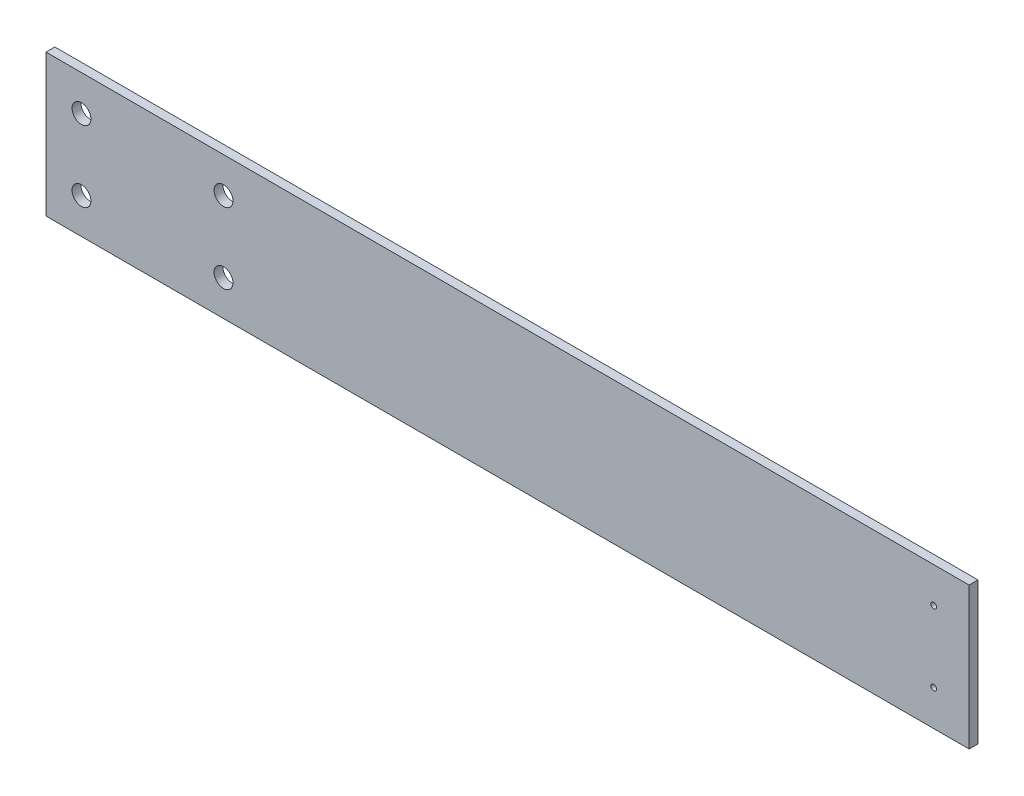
ISO-10303-21;
HEADER;
FILE_DESCRIPTION(('STEP AP214'),'2;1');
FILE_NAME('part.step','',(''),(''),'','','');
FILE_SCHEMA(('AUTOMOTIVE_DESIGN { 1 0 10303 214 1 1 1 1 }'));
ENDSEC;
DATA;
#1=APPLICATION_CONTEXT('core data for automotive mechanical design processes');
#2=APPLICATION_PROTOCOL_DEFINITION('international standard','automotive_design',2000,#1);
#3=PRODUCT_CONTEXT('',#1,'mechanical');
#4=PRODUCT('Part','Part','',(#3));
#5=PRODUCT_RELATED_PRODUCT_CATEGORY('part','',(#4));
#6=PRODUCT_DEFINITION_FORMATION('','',#4);
#7=PRODUCT_DEFINITION_CONTEXT('part definition',#1,'design');
#8=PRODUCT_DEFINITION('design','',#6,#7);
#9=PRODUCT_DEFINITION_SHAPE('','',#8);
#10=(LENGTH_UNIT() NAMED_UNIT(*) SI_UNIT(.MILLI.,.METRE.));
#11=(NAMED_UNIT(*) PLANE_ANGLE_UNIT() SI_UNIT($,.RADIAN.));
#12=(NAMED_UNIT(*) SI_UNIT($,.STERADIAN.) SOLID_ANGLE_UNIT());
#13=UNCERTAINTY_MEASURE_WITH_UNIT(LENGTH_MEASURE(1.E-05),#10,'distance_accuracy_value','');
#14=(GEOMETRIC_REPRESENTATION_CONTEXT(3) GLOBAL_UNCERTAINTY_ASSIGNED_CONTEXT((#13)) GLOBAL_UNIT_ASSIGNED_CONTEXT((#10,
#11,#12)) REPRESENTATION_CONTEXT('',''));
#15=CARTESIAN_POINT('',(0.,0.,0.));
#16=DIRECTION('',(0.,0.,1.));
#17=DIRECTION('',(1.,0.,0.));
#18=AXIS2_PLACEMENT_3D('',#15,#16,#17);
#19=CARTESIAN_POINT('',(0.,0.,3.175));
#20=DIRECTION('',(1.,0.,0.));
#21=DIRECTION('',(0.,0.,-1.));
#22=AXIS2_PLACEMENT_3D('',#19,#20,#21);
#23=PLANE('',#22);
#24=DIRECTION('',(0.,-1.,0.));
#25=VECTOR('',#24,1.);
#26=CARTESIAN_POINT('',(0.,0.,0.));
#27=LINE('',#26,#25);
#28=CARTESIAN_POINT('',(0.,50.8,0.));
#29=VERTEX_POINT('',#28);
#30=CARTESIAN_POINT('',(0.,0.,0.));
#31=VERTEX_POINT('',#30);
#32=EDGE_CURVE('E96',#29,#31,#27,.T.);
#33=ORIENTED_EDGE('',*,*,#32,.T.);
#34=DIRECTION('',(0.,0.,-1.));
#35=VECTOR('',#34,1.);
#36=CARTESIAN_POINT('',(0.,0.,3.175));
#37=LINE('',#36,#35);
#38=CARTESIAN_POINT('',(0.,0.,3.175));
#39=VERTEX_POINT('',#38);
#40=EDGE_CURVE('E11',#39,#31,#37,.T.);
#41=ORIENTED_EDGE('',*,*,#40,.F.);
#42=DIRECTION('',(0.,-1.,0.));
#43=VECTOR('',#42,1.);
#44=CARTESIAN_POINT('',(0.,0.,3.175));
#45=LINE('',#44,#43);
#46=CARTESIAN_POINT('',(0.,50.8,3.175));
#47=VERTEX_POINT('',#46);
#48=EDGE_CURVE('E84',#47,#39,#45,.T.);
#49=ORIENTED_EDGE('',*,*,#48,.F.);
#50=DIRECTION('',(0.,0.,-1.));
#51=VECTOR('',#50,1.);
#52=CARTESIAN_POINT('',(0.,50.8,3.175));
#53=LINE('',#52,#51);
#54=EDGE_CURVE('E92',#47,#29,#53,.T.);
#55=ORIENTED_EDGE('',*,*,#54,.T.);
#56=EDGE_LOOP('',(#33,#41,#49,#55));
#57=FACE_BOUND('',#56,.T.);
#58=ADVANCED_FACE('F33',(#57),#23,.F.);
#59=CARTESIAN_POINT('',(0.,0.,3.175));
#60=DIRECTION('',(0.,1.,0.));
#61=DIRECTION('',(0.,0.,1.));
#62=AXIS2_PLACEMENT_3D('',#59,#60,#61);
#63=PLANE('',#62);
#64=DIRECTION('',(1.,0.,0.));
#65=VECTOR('',#64,1.);
#66=CARTESIAN_POINT('',(0.,0.,0.));
#67=LINE('',#66,#65);
#68=CARTESIAN_POINT('',(330.2,0.,0.));
#69=VERTEX_POINT('',#68);
#70=EDGE_CURVE('E88',#31,#69,#67,.T.);
#71=ORIENTED_EDGE('',*,*,#70,.T.);
#72=DIRECTION('',(0.,0.,-1.));
#73=VECTOR('',#72,1.);
#74=CARTESIAN_POINT('',(330.2,0.,3.175));
#75=LINE('',#74,#73);
#76=CARTESIAN_POINT('',(330.2,0.,3.175));
#77=VERTEX_POINT('',#76);
#78=EDGE_CURVE('E41',#77,#69,#75,.T.);
#79=ORIENTED_EDGE('',*,*,#78,.F.);
#80=DIRECTION('',(1.,0.,0.));
#81=VECTOR('',#80,1.);
#82=CARTESIAN_POINT('',(0.,0.,3.175));
#83=LINE('',#82,#81);
#84=EDGE_CURVE('E79',#39,#77,#83,.T.);
#85=ORIENTED_EDGE('',*,*,#84,.F.);
#86=ORIENTED_EDGE('',*,*,#40,.T.);
#87=EDGE_LOOP('',(#71,#79,#85,#86));
#88=FACE_BOUND('',#87,.T.);
#89=ADVANCED_FACE('F87',(#88),#63,.F.);
#90=CARTESIAN_POINT('',(330.2,0.,3.175));
#91=DIRECTION('',(-1.,0.,0.));
#92=DIRECTION('',(0.,0.,1.));
#93=AXIS2_PLACEMENT_3D('',#90,#91,#92);
#94=PLANE('',#93);
#95=DIRECTION('',(0.,1.,0.));
#96=VECTOR('',#95,1.);
#97=CARTESIAN_POINT('',(330.2,0.,0.));
#98=LINE('',#97,#96);
#99=CARTESIAN_POINT('',(330.2,50.8,0.));
#100=VERTEX_POINT('',#99);
#101=EDGE_CURVE('E66',#69,#100,#98,.T.);
#102=ORIENTED_EDGE('',*,*,#101,.T.);
#103=DIRECTION('',(0.,0.,-1.));
#104=VECTOR('',#103,1.);
#105=CARTESIAN_POINT('',(330.2,50.8,3.175));
#106=LINE('',#105,#104);
#107=CARTESIAN_POINT('',(330.2,50.8,3.175));
#108=VERTEX_POINT('',#107);
#109=EDGE_CURVE('E89',#108,#100,#106,.T.);
#110=ORIENTED_EDGE('',*,*,#109,.F.);
#111=DIRECTION('',(0.,1.,0.));
#112=VECTOR('',#111,1.);
#113=CARTESIAN_POINT('',(330.2,0.,3.175));
#114=LINE('',#113,#112);
#115=EDGE_CURVE('E82',#77,#108,#114,.T.);
#116=ORIENTED_EDGE('',*,*,#115,.F.);
#117=ORIENTED_EDGE('',*,*,#78,.T.);
#118=EDGE_LOOP('',(#102,#110,#116,#117));
#119=FACE_BOUND('',#118,.T.);
#120=ADVANCED_FACE('F90',(#119),#94,.F.);
#121=CARTESIAN_POINT('',(0.,50.8,3.175));
#122=DIRECTION('',(0.,-1.,0.));
#123=DIRECTION('',(0.,0.,-1.));
#124=AXIS2_PLACEMENT_3D('',#121,#122,#123);
#125=PLANE('',#124);
#126=DIRECTION('',(-1.,0.,0.));
#127=VECTOR('',#126,1.);
#128=CARTESIAN_POINT('',(0.,50.8,0.));
#129=LINE('',#128,#127);
#130=EDGE_CURVE('E72',#100,#29,#129,.T.);
#131=ORIENTED_EDGE('',*,*,#130,.T.);
#132=ORIENTED_EDGE('',*,*,#54,.F.);
#133=DIRECTION('',(-1.,0.,0.));
#134=VECTOR('',#133,1.);
#135=CARTESIAN_POINT('',(0.,50.8,3.175));
#136=LINE('',#135,#134);
#137=EDGE_CURVE('E49',#108,#47,#136,.T.);
#138=ORIENTED_EDGE('',*,*,#137,.F.);
#139=ORIENTED_EDGE('',*,*,#109,.T.);
#140=EDGE_LOOP('',(#131,#132,#138,#139));
#141=FACE_BOUND('',#140,.T.);
#142=ADVANCED_FACE('F104',(#141),#125,.F.);
#143=CARTESIAN_POINT('',(0.,0.,3.175));
#144=DIRECTION('',(0.,0.,-1.));
#145=DIRECTION('',(-1.,0.,0.));
#146=AXIS2_PLACEMENT_3D('',#143,#144,#145);
#147=PLANE('',#146);
#148=CARTESIAN_POINT('',(317.5,38.1,3.175));
#149=DIRECTION('',(0.,0.,1.));
#150=DIRECTION('',(1.,0.,0.));
#151=AXIS2_PLACEMENT_3D('',#148,#149,#150);
#152=CIRCLE('',#151,1.02869999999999);
#153=CARTESIAN_POINT('',(318.5287,38.1,3.175));
#154=VERTEX_POINT('',#153);
#155=EDGE_CURVE('E142',#154,#154,#152,.T.);
#156=ORIENTED_EDGE('',*,*,#155,.F.);
#157=EDGE_LOOP('',(#156));
#158=FACE_BOUND('',#157,.T.);
#159=CARTESIAN_POINT('',(317.5,12.7,3.175));
#160=DIRECTION('',(0.,0.,1.));
#161=DIRECTION('',(1.,0.,0.));
#162=AXIS2_PLACEMENT_3D('',#159,#160,#161);
#163=CIRCLE('',#162,1.02869999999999);
#164=CARTESIAN_POINT('',(318.5287,12.7,3.175));
#165=VERTEX_POINT('',#164);
#166=EDGE_CURVE('E136',#165,#165,#163,.T.);
#167=ORIENTED_EDGE('',*,*,#166,.F.);
#168=EDGE_LOOP('',(#167));
#169=FACE_BOUND('',#168,.T.);
#170=CARTESIAN_POINT('',(12.7,38.1,3.175));
#171=DIRECTION('',(0.,0.,1.));
#172=DIRECTION('',(1.,0.,0.));
#173=AXIS2_PLACEMENT_3D('',#170,#171,#172);
#174=CIRCLE('',#173,3.37819999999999);
#175=CARTESIAN_POINT('',(16.0782,38.1,3.175));
#176=VERTEX_POINT('',#175);
#177=EDGE_CURVE('E130',#176,#176,#174,.T.);
#178=ORIENTED_EDGE('',*,*,#177,.F.);
#179=EDGE_LOOP('',(#178));
#180=FACE_BOUND('',#179,.T.);
#181=CARTESIAN_POINT('',(12.7,12.7,3.175));
#182=DIRECTION('',(0.,0.,1.));
#183=DIRECTION('',(1.,0.,0.));
#184=AXIS2_PLACEMENT_3D('',#181,#182,#183);
#185=CIRCLE('',#184,3.37819999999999);
#186=CARTESIAN_POINT('',(16.0782,12.7,3.175));
#187=VERTEX_POINT('',#186);
#188=EDGE_CURVE('E124',#187,#187,#185,.T.);
#189=ORIENTED_EDGE('',*,*,#188,.F.);
#190=EDGE_LOOP('',(#189));
#191=FACE_BOUND('',#190,.T.);
#192=CARTESIAN_POINT('',(63.5,12.7,3.175));
#193=DIRECTION('',(0.,0.,1.));
#194=DIRECTION('',(1.,0.,0.));
#195=AXIS2_PLACEMENT_3D('',#192,#193,#194);
#196=CIRCLE('',#195,3.37819999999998);
#197=CARTESIAN_POINT('',(66.8782,12.7,3.175));
#198=VERTEX_POINT('',#197);
#199=EDGE_CURVE('E118',#198,#198,#196,.T.);
#200=ORIENTED_EDGE('',*,*,#199,.F.);
#201=EDGE_LOOP('',(#200));
#202=FACE_BOUND('',#201,.T.);
#203=CARTESIAN_POINT('',(63.5,38.1,3.175));
#204=DIRECTION('',(0.,0.,1.));
#205=DIRECTION('',(1.,0.,0.));
#206=AXIS2_PLACEMENT_3D('',#203,#204,#205);
#207=CIRCLE('',#206,3.37819999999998);
#208=CARTESIAN_POINT('',(66.8782,38.1,3.175));
#209=VERTEX_POINT('',#208);
#210=EDGE_CURVE('E112',#209,#209,#207,.T.);
#211=ORIENTED_EDGE('',*,*,#210,.F.);
#212=EDGE_LOOP('',(#211));
#213=FACE_BOUND('',#212,.T.);
#214=ORIENTED_EDGE('',*,*,#48,.T.);
#215=ORIENTED_EDGE('',*,*,#84,.T.);
#216=ORIENTED_EDGE('',*,*,#115,.T.);
#217=ORIENTED_EDGE('',*,*,#137,.T.);
#218=EDGE_LOOP('',(#214,#215,#216,#217));
#219=FACE_BOUND('',#218,.T.);
#220=ADVANCED_FACE('F80',(#158,#169,#180,#191,#202,#213,#219),#147,.F.);
#221=CARTESIAN_POINT('',(0.,0.,0.));
#222=DIRECTION('',(0.,0.,-1.));
#223=DIRECTION('',(-1.,0.,0.));
#224=AXIS2_PLACEMENT_3D('',#221,#222,#223);
#225=PLANE('',#224);
#226=CARTESIAN_POINT('',(317.5,38.1,0.));
#227=DIRECTION('',(0.,0.,1.));
#228=DIRECTION('',(1.,0.,0.));
#229=AXIS2_PLACEMENT_3D('',#226,#227,#228);
#230=CIRCLE('',#229,1.02869999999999);
#231=CARTESIAN_POINT('',(318.5287,38.1,0.));
#232=VERTEX_POINT('',#231);
#233=EDGE_CURVE('E139',#232,#232,#230,.T.);
#234=ORIENTED_EDGE('',*,*,#233,.T.);
#235=EDGE_LOOP('',(#234));
#236=FACE_BOUND('',#235,.T.);
#237=CARTESIAN_POINT('',(317.5,12.7,0.));
#238=DIRECTION('',(0.,0.,1.));
#239=DIRECTION('',(1.,0.,0.));
#240=AXIS2_PLACEMENT_3D('',#237,#238,#239);
#241=CIRCLE('',#240,1.02869999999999);
#242=CARTESIAN_POINT('',(318.5287,12.7,0.));
#243=VERTEX_POINT('',#242);
#244=EDGE_CURVE('E133',#243,#243,#241,.T.);
#245=ORIENTED_EDGE('',*,*,#244,.T.);
#246=EDGE_LOOP('',(#245));
#247=FACE_BOUND('',#246,.T.);
#248=CARTESIAN_POINT('',(12.7,38.1,0.));
#249=DIRECTION('',(0.,0.,1.));
#250=DIRECTION('',(1.,0.,0.));
#251=AXIS2_PLACEMENT_3D('',#248,#249,#250);
#252=CIRCLE('',#251,3.3782);
#253=CARTESIAN_POINT('',(16.0782,38.1,0.));
#254=VERTEX_POINT('',#253);
#255=EDGE_CURVE('E127',#254,#254,#252,.T.);
#256=ORIENTED_EDGE('',*,*,#255,.T.);
#257=EDGE_LOOP('',(#256));
#258=FACE_BOUND('',#257,.T.);
#259=CARTESIAN_POINT('',(12.7,12.7,0.));
#260=DIRECTION('',(0.,0.,1.));
#261=DIRECTION('',(1.,0.,0.));
#262=AXIS2_PLACEMENT_3D('',#259,#260,#261);
#263=CIRCLE('',#262,3.3782);
#264=CARTESIAN_POINT('',(16.0782,12.7,0.));
#265=VERTEX_POINT('',#264);
#266=EDGE_CURVE('E121',#265,#265,#263,.T.);
#267=ORIENTED_EDGE('',*,*,#266,.T.);
#268=EDGE_LOOP('',(#267));
#269=FACE_BOUND('',#268,.T.);
#270=CARTESIAN_POINT('',(63.5,12.7,0.));
#271=DIRECTION('',(0.,0.,1.));
#272=DIRECTION('',(1.,0.,0.));
#273=AXIS2_PLACEMENT_3D('',#270,#271,#272);
#274=CIRCLE('',#273,3.3782);
#275=CARTESIAN_POINT('',(66.8782,12.7,0.));
#276=VERTEX_POINT('',#275);
#277=EDGE_CURVE('E115',#276,#276,#274,.T.);
#278=ORIENTED_EDGE('',*,*,#277,.T.);
#279=EDGE_LOOP('',(#278));
#280=FACE_BOUND('',#279,.T.);
#281=CARTESIAN_POINT('',(63.5,38.1,0.));
#282=DIRECTION('',(0.,0.,1.));
#283=DIRECTION('',(1.,0.,0.));
#284=AXIS2_PLACEMENT_3D('',#281,#282,#283);
#285=CIRCLE('',#284,3.3782);
#286=CARTESIAN_POINT('',(66.8782,38.1,0.));
#287=VERTEX_POINT('',#286);
#288=EDGE_CURVE('E99',#287,#287,#285,.T.);
#289=ORIENTED_EDGE('',*,*,#288,.T.);
#290=EDGE_LOOP('',(#289));
#291=FACE_BOUND('',#290,.T.);
#292=ORIENTED_EDGE('',*,*,#32,.F.);
#293=ORIENTED_EDGE('',*,*,#130,.F.);
#294=ORIENTED_EDGE('',*,*,#101,.F.);
#295=ORIENTED_EDGE('',*,*,#70,.F.);
#296=EDGE_LOOP('',(#292,#293,#294,#295));
#297=FACE_BOUND('',#296,.T.);
#298=ADVANCED_FACE('F107',(#236,#247,#258,#269,#280,#291,#297),#225,.T.);
#299=CARTESIAN_POINT('',(63.5,38.1,3.175));
#300=DIRECTION('',(0.,0.,1.));
#301=DIRECTION('',(1.,0.,0.));
#302=AXIS2_PLACEMENT_3D('',#299,#300,#301);
#303=CYLINDRICAL_SURFACE('',#302,3.37819999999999);
#304=ORIENTED_EDGE('',*,*,#288,.F.);
#305=EDGE_LOOP('',(#304));
#306=FACE_BOUND('',#305,.T.);
#307=ORIENTED_EDGE('',*,*,#210,.T.);
#308=EDGE_LOOP('',(#307));
#309=FACE_BOUND('',#308,.T.);
#310=ADVANCED_FACE('F161',(#306,#309),#303,.F.);
#311=CARTESIAN_POINT('',(63.5,12.7,3.175));
#312=DIRECTION('',(0.,0.,1.));
#313=DIRECTION('',(1.,0.,0.));
#314=AXIS2_PLACEMENT_3D('',#311,#312,#313);
#315=CYLINDRICAL_SURFACE('',#314,3.37819999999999);
#316=ORIENTED_EDGE('',*,*,#277,.F.);
#317=EDGE_LOOP('',(#316));
#318=FACE_BOUND('',#317,.T.);
#319=ORIENTED_EDGE('',*,*,#199,.T.);
#320=EDGE_LOOP('',(#319));
#321=FACE_BOUND('',#320,.T.);
#322=ADVANCED_FACE('F163',(#318,#321),#315,.F.);
#323=CARTESIAN_POINT('',(12.7,12.7,3.175));
#324=DIRECTION('',(0.,0.,1.));
#325=DIRECTION('',(1.,0.,0.));
#326=AXIS2_PLACEMENT_3D('',#323,#324,#325);
#327=CYLINDRICAL_SURFACE('',#326,3.37819999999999);
#328=ORIENTED_EDGE('',*,*,#266,.F.);
#329=EDGE_LOOP('',(#328));
#330=FACE_BOUND('',#329,.T.);
#331=ORIENTED_EDGE('',*,*,#188,.T.);
#332=EDGE_LOOP('',(#331));
#333=FACE_BOUND('',#332,.T.);
#334=ADVANCED_FACE('F170',(#330,#333),#327,.F.);
#335=CARTESIAN_POINT('',(12.7,38.1,3.175));
#336=DIRECTION('',(0.,0.,1.));
#337=DIRECTION('',(1.,0.,0.));
#338=AXIS2_PLACEMENT_3D('',#335,#336,#337);
#339=CYLINDRICAL_SURFACE('',#338,3.37819999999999);
#340=ORIENTED_EDGE('',*,*,#255,.F.);
#341=EDGE_LOOP('',(#340));
#342=FACE_BOUND('',#341,.T.);
#343=ORIENTED_EDGE('',*,*,#177,.T.);
#344=EDGE_LOOP('',(#343));
#345=FACE_BOUND('',#344,.T.);
#346=ADVANCED_FACE('F210',(#342,#345),#339,.F.);
#347=CARTESIAN_POINT('',(317.5,12.7,3.175));
#348=DIRECTION('',(0.,0.,1.));
#349=DIRECTION('',(1.,0.,0.));
#350=AXIS2_PLACEMENT_3D('',#347,#348,#349);
#351=CYLINDRICAL_SURFACE('',#350,1.02869999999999);
#352=ORIENTED_EDGE('',*,*,#244,.F.);
#353=EDGE_LOOP('',(#352));
#354=FACE_BOUND('',#353,.T.);
#355=ORIENTED_EDGE('',*,*,#166,.T.);
#356=EDGE_LOOP('',(#355));
#357=FACE_BOUND('',#356,.T.);
#358=ADVANCED_FACE('F205',(#354,#357),#351,.F.);
#359=CARTESIAN_POINT('',(317.5,38.1,3.175));
#360=DIRECTION('',(0.,0.,1.));
#361=DIRECTION('',(1.,0.,0.));
#362=AXIS2_PLACEMENT_3D('',#359,#360,#361);
#363=CYLINDRICAL_SURFACE('',#362,1.02869999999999);
#364=ORIENTED_EDGE('',*,*,#233,.F.);
#365=EDGE_LOOP('',(#364));
#366=FACE_BOUND('',#365,.T.);
#367=ORIENTED_EDGE('',*,*,#155,.T.);
#368=EDGE_LOOP('',(#367));
#369=FACE_BOUND('',#368,.T.);
#370=ADVANCED_FACE('F146',(#366,#369),#363,.F.);
#371=CLOSED_SHELL('',(#58,#89,#120,#142,#220,#298,#310,#322,#334,#346,#358,#370));
#372=MANIFOLD_SOLID_BREP('B2',#371);
#373=ADVANCED_BREP_SHAPE_REPRESENTATION('',(#18,#372),#14);
#374=SHAPE_DEFINITION_REPRESENTATION(#9,#373);
ENDSEC;
END-ISO-10303-21;
